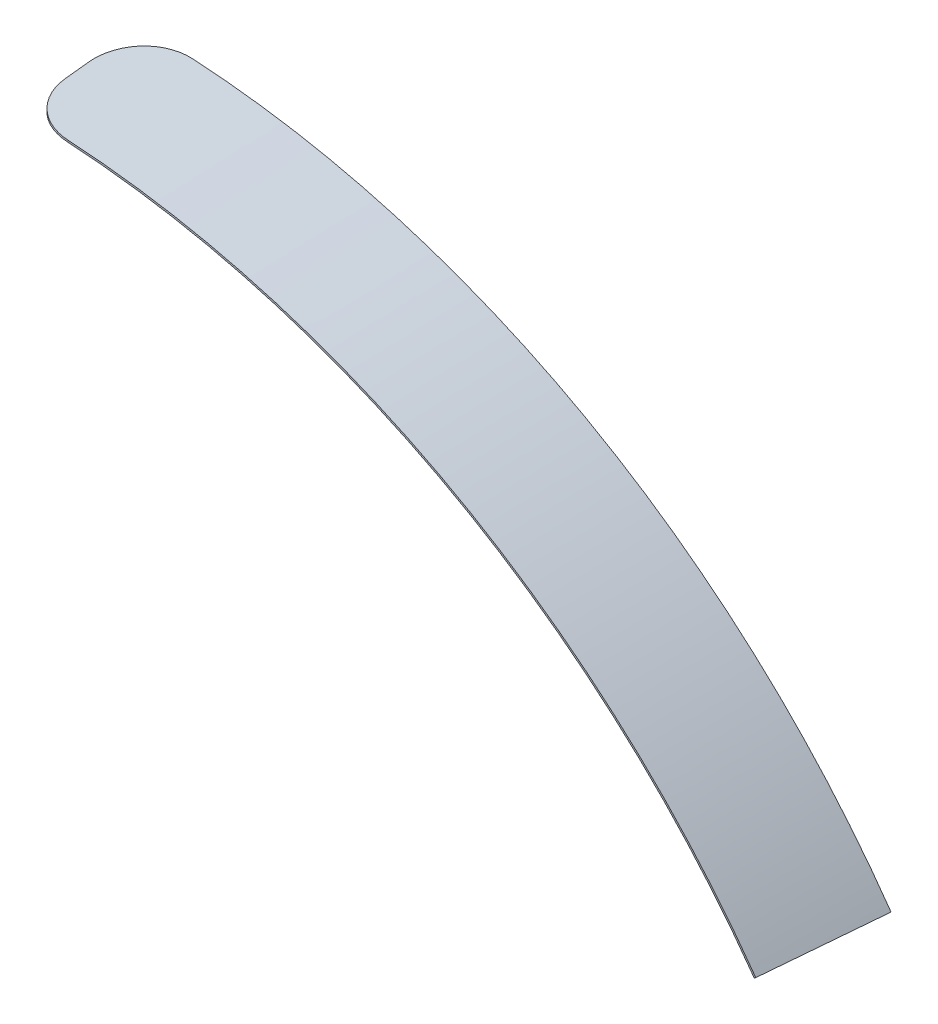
from build123d import *

# Parameters (mm, degrees)
EXTRU_MINCE1_DEPTH = 25
EXTRU_MINCE1_DRAFT = 3
CONG_1_R           = 10


with BuildPart() as part:
    # Esquisse1 → Extru.-Mince1 (with draft: the straight prism first)
    with BuildSketch(Plane.XY):
        with BuildLine():
            Line((0, 182), (0, 179))
            ThreePointArc((0, 179), (82.653001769, 158.774939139), (146.628215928, 102.670182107))
            Line((146.628215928, 102.670182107), (149.085672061, 104.390911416))
            ThreePointArc((149.085672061, 104.390911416), (84.038247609, 161.435971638), (0, 182))
        make_face()
    extrude(amount=EXTRU_MINCE1_DEPTH)
    # Extru.-Mince1: the draft: its side faces are tilted about the plane it starts from
    extru_mince1_sides = [part.faces().sort_by_distance(p)[0] for p in [
        (84.038247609, 161.435971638, 12.5),
        (0, 180.5, 12.5),
        (82.653001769, 158.774939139, 12.5),
        (147.856943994, 103.530546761, 12.5),
    ]]
    draft(extru_mince1_sides, Plane.XY, EXTRU_MINCE1_DRAFT)

    # Cong_1
    cong_1_edges = [part.edges().sort_by_distance(p)[0] for p in [
        (1.310194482, 180.495244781, 25),
        (0, 180.5, 0),
    ]]
    fillet(cong_1_edges, radius=CONG_1_R)


solid = part.part
